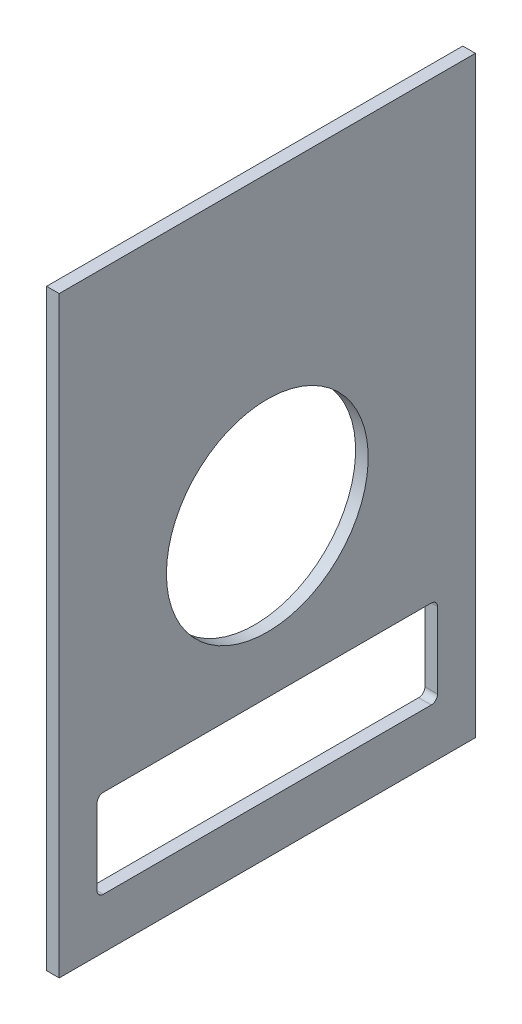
from build123d import *

# Parameters (mm, degrees)
SKETCH1_W          = 419.1
SKETCH1_H          = 596.9
EXTRUDE1_DEPTH     = 12.7
SKETCH2_R          = 101.6
SKETCH2_W          = 342.9
SKETCH2_H          = 88.9
CUT_EXTRUDE1_DEPTH = 365.890250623
FILLET1_R          = 6.35


with BuildPart() as part:
    # Sketch1 → Extrude1 (new body)
    with BuildSketch(Plane(origin=(0, 0, 0), x_dir=(0, 0, -1), z_dir=(1, 0, 0))):
        Rectangle(SKETCH1_W, SKETCH1_H)
    extrude(amount=EXTRUDE1_DEPTH)

    # Sketch2 → Cut-Extrude1 (cut, through all)
    with BuildSketch(Plane.ZY):
        Circle(SKETCH2_R)
        with Locations((0, -203.2)):
            Rectangle(SKETCH2_W, SKETCH2_H)
    extrude(amount=-CUT_EXTRUDE1_DEPTH, mode=Mode.SUBTRACT)

    # Fillet1
    fillet1_edges = [part.edges().sort_by_distance(p)[0] for p in [
        (6.35, -247.65, -171.45),
        (6.35, -158.75, -171.45),
        (6.35, -158.75, 171.45),
        (6.35, -247.65, 171.45),
    ]]
    fillet(fillet1_edges, radius=FILLET1_R)


solid = part.part
